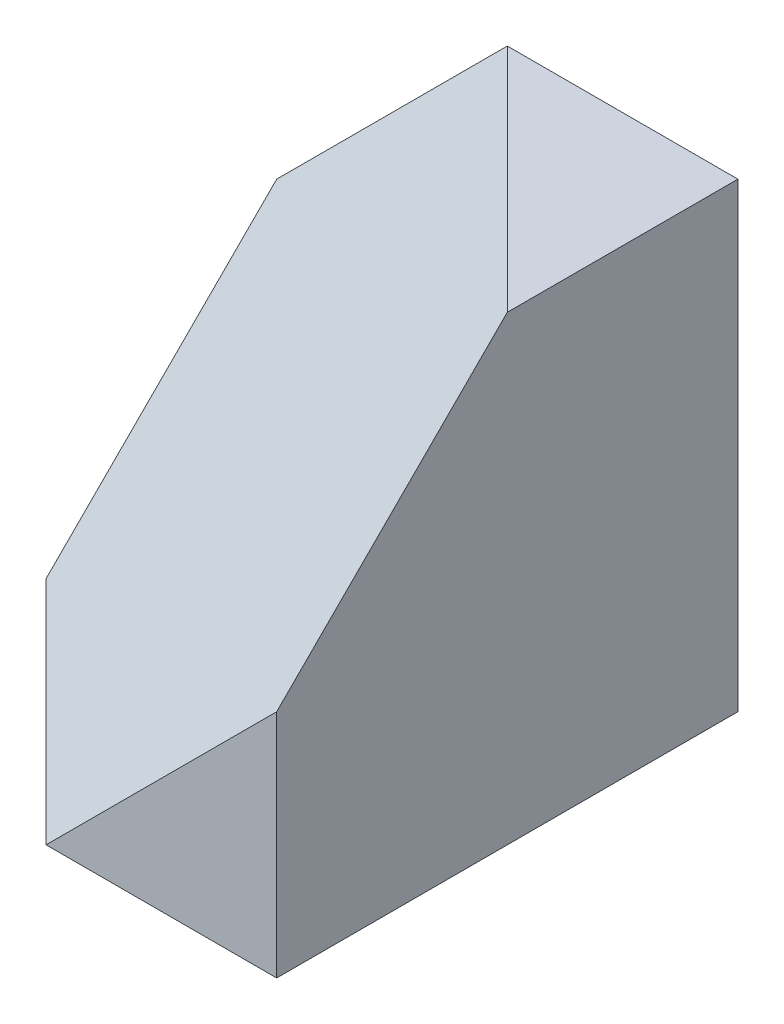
from build123d import *

# Parameters (mm, degrees)
SKETCH_1_W      = 10
SKETCH_1_H      = 10
EXTRUDE_1_DEPTH = 10


with BuildPart() as part:
    # Sketch 1 → Extrude 1 (new body)
    with BuildSketch(Plane.XY):
        with Locations((5, 5)):
            Rectangle(SKETCH_1_W, SKETCH_1_H)
    extrude(amount=-EXTRUDE_1_DEPTH)

    # Surface Cut 1
    split(bisect_by=Plane(origin=(1.666666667, -1.666666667, -1.666666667), x_dir=(-0.8164965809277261, -0.4082482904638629, -0.4082482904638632), z_dir=(0.5773502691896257, -0.5773502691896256, -0.577350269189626)), keep=Keep.TOP)


solid = part.part
